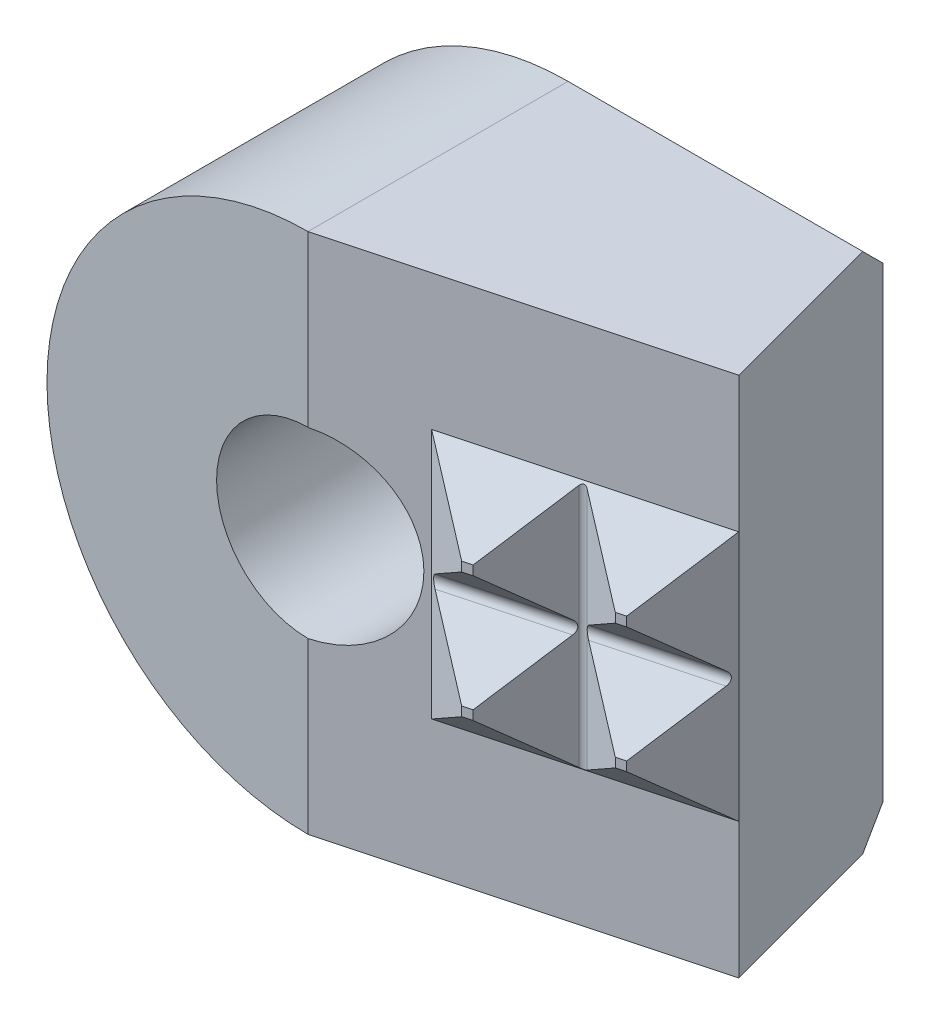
ISO-10303-21;
HEADER;
FILE_DESCRIPTION(('STEP AP214'),'2;1');
FILE_NAME('part.step','',(''),(''),'','','');
FILE_SCHEMA(('AUTOMOTIVE_DESIGN { 1 0 10303 214 1 1 1 1 }'));
ENDSEC;
DATA;
#1=APPLICATION_CONTEXT('core data for automotive mechanical design processes');
#2=APPLICATION_PROTOCOL_DEFINITION('international standard','automotive_design',2000,#1);
#3=PRODUCT_CONTEXT('',#1,'mechanical');
#4=PRODUCT('Part','Part','',(#3));
#5=PRODUCT_RELATED_PRODUCT_CATEGORY('part','',(#4));
#6=PRODUCT_DEFINITION_FORMATION('','',#4);
#7=PRODUCT_DEFINITION_CONTEXT('part definition',#1,'design');
#8=PRODUCT_DEFINITION('design','',#6,#7);
#9=PRODUCT_DEFINITION_SHAPE('','',#8);
#10=(LENGTH_UNIT() NAMED_UNIT(*) SI_UNIT(.MILLI.,.METRE.));
#11=(NAMED_UNIT(*) PLANE_ANGLE_UNIT() SI_UNIT($,.RADIAN.));
#12=(NAMED_UNIT(*) SI_UNIT($,.STERADIAN.) SOLID_ANGLE_UNIT());
#13=UNCERTAINTY_MEASURE_WITH_UNIT(LENGTH_MEASURE(1.E-05),#10,'distance_accuracy_value','');
#14=(GEOMETRIC_REPRESENTATION_CONTEXT(3) GLOBAL_UNCERTAINTY_ASSIGNED_CONTEXT((#13)) GLOBAL_UNIT_ASSIGNED_CONTEXT((#10,
#11,#12)) REPRESENTATION_CONTEXT('',''));
#15=CARTESIAN_POINT('',(0.,0.,0.));
#16=DIRECTION('',(0.,0.,1.));
#17=DIRECTION('',(1.,0.,0.));
#18=AXIS2_PLACEMENT_3D('',#15,#16,#17);
#19=CARTESIAN_POINT('',(2.66743829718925,-7.1374,7.16091854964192));
#20=DIRECTION('',(-0.258819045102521,0.,-0.965925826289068));
#21=DIRECTION('',(0.965925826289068,0.,-0.258819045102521));
#22=AXIS2_PLACEMENT_3D('',#19,#20,#21);
#23=PLANE('',#22);
#24=DIRECTION('',(0.,1.,0.));
#25=VECTOR('',#24,1.);
#26=CARTESIAN_POINT('',(0.00618209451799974,-7.1374,7.874));
#27=LINE('',#26,#25);
#28=CARTESIAN_POINT('',(0.00618209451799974,2.49999235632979,7.874));
#29=VERTEX_POINT('',#28);
#30=CARTESIAN_POINT('',(0.00618209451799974,7.1374,7.874));
#31=VERTEX_POINT('',#30);
#32=EDGE_CURVE('E184',#29,#31,#27,.T.);
#33=ORIENTED_EDGE('',*,*,#32,.F.);
#34=CARTESIAN_POINT('',(0.,0.,7.87565648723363));
#35=DIRECTION('',(-0.258819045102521,0.,-0.965925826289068));
#36=DIRECTION('',(0.965925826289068,0.,-0.258819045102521));
#37=AXIS2_PLACEMENT_3D('',#34,#35,#36);
#38=ELLIPSE('',#37,2.58819045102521,2.5);
#39=CARTESIAN_POINT('',(0.00618209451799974,-2.49999235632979,7.874));
#40=VERTEX_POINT('',#39);
#41=EDGE_CURVE('E28',#29,#40,#38,.T.);
#42=ORIENTED_EDGE('',*,*,#41,.T.);
#43=CARTESIAN_POINT('',(0.00618209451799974,-7.1374,7.874));
#44=VERTEX_POINT('',#43);
#45=EDGE_CURVE('E181',#44,#40,#27,.T.);
#46=ORIENTED_EDGE('',*,*,#45,.F.);
#47=DIRECTION('',(-0.965925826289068,0.,0.258819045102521));
#48=VECTOR('',#47,1.);
#49=CARTESIAN_POINT('',(2.66743829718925,-7.1374,7.16091854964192));
#50=LINE('',#49,#48);
#51=CARTESIAN_POINT('',(9.29175761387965,-7.1374,5.38593753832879));
#52=VERTEX_POINT('',#51);
#53=EDGE_CURVE('E272',#52,#44,#50,.T.);
#54=ORIENTED_EDGE('',*,*,#53,.F.);
#55=DIRECTION('',(0.,1.,0.));
#56=VECTOR('',#55,1.);
#57=CARTESIAN_POINT('',(9.29175761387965,-7.1374,5.3859375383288));
#58=LINE('',#57,#56);
#59=CARTESIAN_POINT('',(9.2917576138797,-3.4289999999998,5.38593753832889));
#60=VERTEX_POINT('',#59);
#61=EDGE_CURVE('E264',#52,#60,#58,.T.);
#62=ORIENTED_EDGE('',*,*,#61,.T.);
#63=DIRECTION('',(0.965925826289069,0.,-0.25881904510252));
#64=VECTOR('',#63,1.);
#65=CARTESIAN_POINT('',(-6.76123337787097,-3.4289999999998,9.68732351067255));
#66=LINE('',#65,#64);
#67=CARTESIAN_POINT('',(2.66743829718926,-3.4289999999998,7.16091854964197));
#68=VERTEX_POINT('',#67);
#69=EDGE_CURVE('E356',#68,#60,#66,.T.);
#70=ORIENTED_EDGE('',*,*,#69,.F.);
#71=DIRECTION('',(0.,1.,0.));
#72=VECTOR('',#71,1.);
#73=CARTESIAN_POINT('',(2.66743829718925,-7.1374,7.16091854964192));
#74=LINE('',#73,#72);
#75=CARTESIAN_POINT('',(2.66743829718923,3.42900000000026,7.16091854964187));
#76=VERTEX_POINT('',#75);
#77=EDGE_CURVE('E189',#68,#76,#74,.T.);
#78=ORIENTED_EDGE('',*,*,#77,.T.);
#79=DIRECTION('',(0.965925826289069,0.,-0.25881904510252));
#80=VECTOR('',#79,1.);
#81=CARTESIAN_POINT('',(-6.761233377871,3.42900000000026,9.68732351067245));
#82=LINE('',#81,#80);
#83=CARTESIAN_POINT('',(9.29175761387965,3.42900000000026,5.3859375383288));
#84=VERTEX_POINT('',#83);
#85=EDGE_CURVE('E355',#76,#84,#82,.T.);
#86=ORIENTED_EDGE('',*,*,#85,.T.);
#87=DIRECTION('',(0.,-1.,0.));
#88=VECTOR('',#87,1.);
#89=CARTESIAN_POINT('',(9.2917576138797,7.57101253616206,5.38593753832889));
#90=LINE('',#89,#88);
#91=CARTESIAN_POINT('',(9.29175761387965,7.1374,5.3859375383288));
#92=VERTEX_POINT('',#91);
#93=EDGE_CURVE('E185',#92,#84,#90,.T.);
#94=ORIENTED_EDGE('',*,*,#93,.F.);
#95=DIRECTION('',(-0.965925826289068,0.,0.258819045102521));
#96=VECTOR('',#95,1.);
#97=CARTESIAN_POINT('',(2.66743829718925,7.1374,7.16091854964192));
#98=LINE('',#97,#96);
#99=EDGE_CURVE('E278',#92,#31,#98,.T.);
#100=ORIENTED_EDGE('',*,*,#99,.T.);
#101=EDGE_LOOP('',(#33,#42,#46,#54,#62,#70,#78,#86,#94,#100));
#102=FACE_BOUND('',#101,.T.);
#103=ADVANCED_FACE('F14',(#102),#23,.F.);
#104=CARTESIAN_POINT('',(0.00618209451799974,-7.1374,7.874));
#105=DIRECTION('',(0.,0.,-1.));
#106=DIRECTION('',(0.,1.,0.));
#107=AXIS2_PLACEMENT_3D('',#104,#105,#106);
#108=PLANE('',#107);
#109=ORIENTED_EDGE('',*,*,#45,.T.);
#110=CARTESIAN_POINT('',(0.,0.,7.874));
#111=DIRECTION('',(0.,0.,-1.));
#112=DIRECTION('',(0.,1.,0.));
#113=AXIS2_PLACEMENT_3D('',#110,#111,#112);
#114=CIRCLE('',#113,2.5);
#115=EDGE_CURVE('E172',#40,#29,#114,.T.);
#116=ORIENTED_EDGE('',*,*,#115,.T.);
#117=ORIENTED_EDGE('',*,*,#32,.T.);
#118=DIRECTION('',(-1.,0.,0.));
#119=VECTOR('',#118,1.);
#120=CARTESIAN_POINT('',(0.00618209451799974,7.1374,7.874));
#121=LINE('',#120,#119);
#122=CARTESIAN_POINT('',(0.,7.1374,7.874));
#123=VERTEX_POINT('',#122);
#124=EDGE_CURVE('E280',#31,#123,#121,.T.);
#125=ORIENTED_EDGE('',*,*,#124,.T.);
#126=CARTESIAN_POINT('',(0.,0.,7.874));
#127=DIRECTION('',(0.,0.,-1.));
#128=DIRECTION('',(0.,1.,0.));
#129=AXIS2_PLACEMENT_3D('',#126,#127,#128);
#130=CIRCLE('',#129,7.1374);
#131=CARTESIAN_POINT('',(0.,-7.1374,7.874));
#132=VERTEX_POINT('',#131);
#133=EDGE_CURVE('E196',#132,#123,#130,.T.);
#134=ORIENTED_EDGE('',*,*,#133,.F.);
#135=DIRECTION('',(-1.,0.,0.));
#136=VECTOR('',#135,1.);
#137=CARTESIAN_POINT('',(0.00618209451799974,-7.1374,7.874));
#138=LINE('',#137,#136);
#139=EDGE_CURVE('E188',#44,#132,#138,.T.);
#140=ORIENTED_EDGE('',*,*,#139,.F.);
#141=EDGE_LOOP('',(#109,#116,#117,#125,#134,#140));
#142=FACE_BOUND('',#141,.T.);
#143=ADVANCED_FACE('F16',(#142),#108,.F.);
#144=CARTESIAN_POINT('',(9.29175761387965,-7.1374,5.3859375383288));
#145=DIRECTION('',(-0.86602540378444,0.,-0.5));
#146=DIRECTION('',(0.5,0.,-0.86602540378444));
#147=AXIS2_PLACEMENT_3D('',#144,#145,#146);
#148=PLANE('',#147);
#149=EDGE_CURVE('E267',#60,#84,#58,.T.);
#150=ORIENTED_EDGE('',*,*,#149,.T.);
#151=DIRECTION('',(-0.408248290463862,-0.577350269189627,0.707106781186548));
#152=VECTOR('',#151,1.);
#153=CARTESIAN_POINT('',(6.80123324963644,-0.0931333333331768,9.69965227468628));
#154=LINE('',#153,#152);
#155=CARTESIAN_POINT('',(8.169225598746,1.84150000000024,7.33022002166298));
#156=VERTEX_POINT('',#155);
#157=EDGE_CURVE('E321',#84,#156,#154,.T.);
#158=ORIENTED_EDGE('',*,*,#157,.T.);
#159=DIRECTION('',(0.,1.,0.));
#160=VECTOR('',#159,1.);
#161=CARTESIAN_POINT('',(8.169225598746,-7.1374,7.33022002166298));
#162=LINE('',#161,#160);
#163=CARTESIAN_POINT('',(8.169225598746,1.58750000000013,7.33022002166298));
#164=VERTEX_POINT('',#163);
#165=EDGE_CURVE('E260',#164,#156,#162,.T.);
#166=ORIENTED_EDGE('',*,*,#165,.F.);
#167=DIRECTION('',(0.408248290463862,-0.577350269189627,-0.707106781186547));
#168=VECTOR('',#167,1.);
#169=CARTESIAN_POINT('',(10.9740589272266,-2.37913333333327,2.47210618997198));
#170=LINE('',#169,#168);
#171=CARTESIAN_POINT('',(9.1647576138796,0.179605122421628,5.60590799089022));
#172=VERTEX_POINT('',#171);
#173=EDGE_CURVE('E294',#164,#172,#170,.T.);
#174=ORIENTED_EDGE('',*,*,#173,.T.);
#175=CARTESIAN_POINT('',(9.0377576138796,2.45824320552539E-13,5.82587844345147));
#176=DIRECTION('',(-0.86602540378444,0.,-0.5));
#177=DIRECTION('',(0.5,0.,-0.86602540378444));
#178=AXIS2_PLACEMENT_3D('',#175,#176,#177);
#179=ELLIPSE('',#178,0.359210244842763,0.254);
#180=CARTESIAN_POINT('',(9.16475761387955,-0.179605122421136,5.60590799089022));
#181=VERTEX_POINT('',#180);
#182=EDGE_CURVE('E239',#181,#172,#179,.F.);
#183=ORIENTED_EDGE('',*,*,#182,.F.);
#184=DIRECTION('',(0.408248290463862,0.577350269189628,-0.707106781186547));
#185=VECTOR('',#184,1.);
#186=CARTESIAN_POINT('',(7.60945630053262,-2.37913333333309,8.29976888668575));
#187=LINE('',#186,#185);
#188=CARTESIAN_POINT('',(8.169225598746,-1.58749999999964,7.33022002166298));
#189=VERTEX_POINT('',#188);
#190=EDGE_CURVE('E309',#189,#181,#187,.T.);
#191=ORIENTED_EDGE('',*,*,#190,.F.);
#192=CARTESIAN_POINT('',(8.169225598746,-1.84149999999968,7.33022002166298));
#193=VERTEX_POINT('',#192);
#194=EDGE_CURVE('E263',#193,#189,#162,.T.);
#195=ORIENTED_EDGE('',*,*,#194,.F.);
#196=DIRECTION('',(-0.408248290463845,0.577350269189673,0.707106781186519));
#197=VECTOR('',#196,1.);
#198=CARTESIAN_POINT('',(10.1658358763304,-4.66513333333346,3.87198957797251));
#199=LINE('',#198,#197);
#200=EDGE_CURVE('E342',#60,#193,#199,.T.);
#201=ORIENTED_EDGE('',*,*,#200,.F.);
#202=EDGE_LOOP('',(#150,#158,#166,#174,#183,#191,#195,#201));
#203=FACE_BOUND('',#202,.T.);
#204=ADVANCED_FACE('F401',(#203),#148,.F.);
#205=CARTESIAN_POINT('',(8.169225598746,-7.1374,7.33022002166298));
#206=DIRECTION('',(-0.25881904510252,0.,-0.965925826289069));
#207=DIRECTION('',(0.965925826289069,0.,-0.25881904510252));
#208=AXIS2_PLACEMENT_3D('',#205,#206,#207);
#209=PLANE('',#208);
#210=DIRECTION('',(0.965925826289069,0.,-0.25881904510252));
#211=VECTOR('',#210,1.);
#212=CARTESIAN_POINT('',(8.169225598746,-1.58749999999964,7.33022002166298));
#213=LINE('',#212,#211);
#214=CARTESIAN_POINT('',(7.9238804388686,-1.58749999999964,7.39596005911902));
#215=VERTEX_POINT('',#214);
#216=EDGE_CURVE('E311',#215,#189,#213,.T.);
#217=ORIENTED_EDGE('',*,*,#216,.F.);
#218=DIRECTION('',(0.,1.,0.));
#219=VECTOR('',#218,1.);
#220=CARTESIAN_POINT('',(7.9238804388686,-7.1374,7.39596005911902));
#221=LINE('',#220,#219);
#222=CARTESIAN_POINT('',(7.9238804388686,-1.84149999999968,7.39596005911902));
#223=VERTEX_POINT('',#222);
#224=EDGE_CURVE('E259',#223,#215,#221,.T.);
#225=ORIENTED_EDGE('',*,*,#224,.F.);
#226=DIRECTION('',(-0.965925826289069,0.,0.25881904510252));
#227=VECTOR('',#226,1.);
#228=CARTESIAN_POINT('',(8.169225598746,-1.84149999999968,7.33022002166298));
#229=LINE('',#228,#227);
#230=EDGE_CURVE('E344',#193,#223,#229,.T.);
#231=ORIENTED_EDGE('',*,*,#230,.F.);
#232=ORIENTED_EDGE('',*,*,#194,.T.);
#233=EDGE_LOOP('',(#217,#225,#231,#232));
#234=FACE_BOUND('',#233,.T.);
#235=ADVANCED_FACE('F408',(#234),#209,.F.);
#236=ORIENTED_EDGE('',*,*,#165,.T.);
#237=DIRECTION('',(-0.965925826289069,0.,0.25881904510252));
#238=VECTOR('',#237,1.);
#239=CARTESIAN_POINT('',(8.169225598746,1.84150000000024,7.33022002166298));
#240=LINE('',#239,#238);
#241=CARTESIAN_POINT('',(7.9238804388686,1.84150000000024,7.39596005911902));
#242=VERTEX_POINT('',#241);
#243=EDGE_CURVE('E324',#156,#242,#240,.T.);
#244=ORIENTED_EDGE('',*,*,#243,.T.);
#245=CARTESIAN_POINT('',(7.9238804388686,1.58750000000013,7.39596005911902));
#246=VERTEX_POINT('',#245);
#247=EDGE_CURVE('E256',#246,#242,#221,.T.);
#248=ORIENTED_EDGE('',*,*,#247,.F.);
#249=DIRECTION('',(0.965925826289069,0.,-0.25881904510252));
#250=VECTOR('',#249,1.);
#251=CARTESIAN_POINT('',(8.169225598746,1.58750000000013,7.33022002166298));
#252=LINE('',#251,#250);
#253=EDGE_CURVE('E297',#246,#164,#252,.T.);
#254=ORIENTED_EDGE('',*,*,#253,.T.);
#255=EDGE_LOOP('',(#236,#244,#248,#254));
#256=FACE_BOUND('',#255,.T.);
#257=ADVANCED_FACE('F476',(#256),#209,.F.);
#258=CARTESIAN_POINT('',(7.9238804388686,-7.1374,7.39596005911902));
#259=DIRECTION('',(0.5,0.,-0.86602540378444));
#260=DIRECTION('',(0.86602540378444,0.,0.5));
#261=AXIS2_PLACEMENT_3D('',#258,#259,#260);
#262=PLANE('',#261);
#263=ORIENTED_EDGE('',*,*,#247,.T.);
#264=DIRECTION('',(-0.707106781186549,0.577350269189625,-0.408248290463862));
#265=VECTOR('',#264,1.);
#266=CARTESIAN_POINT('',(11.5895010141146,-1.1514666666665,9.51230708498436));
#267=LINE('',#266,#265);
#268=CARTESIAN_POINT('',(6.08958318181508,3.33919743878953,6.33692804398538));
#269=VERTEX_POINT('',#268);
#270=EDGE_CURVE('E327',#242,#269,#267,.T.);
#271=ORIENTED_EDGE('',*,*,#270,.T.);
#272=DIRECTION('',(0.,1.,0.));
#273=VECTOR('',#272,1.);
#274=CARTESIAN_POINT('',(6.08958318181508,-7.1374,6.33692804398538));
#275=LINE('',#274,#273);
#276=CARTESIAN_POINT('',(6.08958318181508,-3.33919743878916,6.33692804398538));
#277=VERTEX_POINT('',#276);
#278=EDGE_CURVE('E253',#277,#269,#275,.T.);
#279=ORIENTED_EDGE('',*,*,#278,.F.);
#280=DIRECTION('',(-0.707106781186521,-0.577350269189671,-0.408248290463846));
#281=VECTOR('',#280,1.);
#282=CARTESIAN_POINT('',(5.7618383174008,-3.60680000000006,6.14770445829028));
#283=LINE('',#282,#281);
#284=EDGE_CURVE('E346',#223,#277,#283,.T.);
#285=ORIENTED_EDGE('',*,*,#284,.F.);
#286=ORIENTED_EDGE('',*,*,#224,.T.);
#287=DIRECTION('',(0.707106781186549,-0.577350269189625,0.408248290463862));
#288=VECTOR('',#287,1.);
#289=CARTESIAN_POINT('',(10.1896176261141,-3.43746666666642,8.70408403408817));
#290=LINE('',#289,#288);
#291=CARTESIAN_POINT('',(6.19956840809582,-0.179605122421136,6.40042804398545));
#292=VERTEX_POINT('',#291);
#293=EDGE_CURVE('E313',#292,#215,#290,.T.);
#294=ORIENTED_EDGE('',*,*,#293,.F.);
#295=CARTESIAN_POINT('',(6.41953886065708,2.45877577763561E-13,6.52742804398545));
#296=DIRECTION('',(0.5,0.,-0.86602540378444));
#297=DIRECTION('',(0.86602540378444,0.,0.5));
#298=AXIS2_PLACEMENT_3D('',#295,#296,#297);
#299=ELLIPSE('',#298,0.359210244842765,0.254);
#300=CARTESIAN_POINT('',(6.19956840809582,0.179605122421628,6.40042804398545));
#301=VERTEX_POINT('',#300);
#302=EDGE_CURVE('E317',#301,#292,#299,.F.);
#303=ORIENTED_EDGE('',*,*,#302,.F.);
#304=DIRECTION('',(0.707106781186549,0.577350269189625,0.408248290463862));
#305=VECTOR('',#304,1.);
#306=CARTESIAN_POINT('',(4.36195492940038,-1.3207999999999,5.33948140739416));
#307=LINE('',#306,#305);
#308=EDGE_CURVE('E300',#301,#246,#307,.T.);
#309=ORIENTED_EDGE('',*,*,#308,.T.);
#310=EDGE_LOOP('',(#263,#271,#279,#285,#286,#294,#303,#309));
#311=FACE_BOUND('',#310,.T.);
#312=ADVANCED_FACE('F420',(#311),#262,.F.);
#313=CARTESIAN_POINT('',(6.0260831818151,-7.1374,6.446913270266));
#314=DIRECTION('',(0.,1.,0.));
#315=DIRECTION('',(0.,0.,1.));
#316=AXIS2_PLACEMENT_3D('',#313,#314,#315);
#317=CYLINDRICAL_SURFACE('',#316,0.126999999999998);
#318=ORIENTED_EDGE('',*,*,#278,.T.);
#319=CARTESIAN_POINT('',(6.0260831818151,3.24939487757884,6.446913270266));
#320=DIRECTION('',(-0.183012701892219,-0.707106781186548,-0.68301270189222));
#321=DIRECTION('',(-0.183012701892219,0.707106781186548,-0.68301270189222));
#322=AXIS2_PLACEMENT_3D('',#319,#320,#321);
#323=ELLIPSE('',#322,0.179605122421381,0.126999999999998);
#324=CARTESIAN_POINT('',(5.91609795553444,3.33919743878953,6.38341327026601));
#325=VERTEX_POINT('',#324);
#326=EDGE_CURVE('E330',#269,#325,#323,.F.);
#327=ORIENTED_EDGE('',*,*,#326,.T.);
#328=DIRECTION('',(0.,1.,0.));
#329=VECTOR('',#328,1.);
#330=CARTESIAN_POINT('',(5.91609795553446,-7.1374,6.38341327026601));
#331=LINE('',#330,#329);
#332=CARTESIAN_POINT('',(5.91609795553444,-3.33919743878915,6.38341327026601));
#333=VERTEX_POINT('',#332);
#334=EDGE_CURVE('E250',#333,#325,#331,.T.);
#335=ORIENTED_EDGE('',*,*,#334,.F.);
#336=CARTESIAN_POINT('',(6.0260831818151,-3.24939487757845,6.446913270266));
#337=DIRECTION('',(0.18301270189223,-0.707106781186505,0.683012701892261));
#338=DIRECTION('',(0.183012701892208,0.70710678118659,0.683012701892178));
#339=AXIS2_PLACEMENT_3D('',#336,#337,#338);
#340=ELLIPSE('',#339,0.179605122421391,0.126999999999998);
#341=EDGE_CURVE('E348',#277,#333,#340,.F.);
#342=ORIENTED_EDGE('',*,*,#341,.F.);
#343=EDGE_LOOP('',(#318,#327,#335,#342));
#344=FACE_BOUND('',#343,.T.);
#345=ADVANCED_FACE('F430',(#344),#317,.F.);
#346=CARTESIAN_POINT('',(5.91609795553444,-7.1374,6.383413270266));
#347=DIRECTION('',(-0.86602540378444,0.,-0.5));
#348=DIRECTION('',(0.5,0.,-0.86602540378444));
#349=AXIS2_PLACEMENT_3D('',#346,#347,#348);
#350=PLANE('',#349);
#351=ORIENTED_EDGE('',*,*,#334,.T.);
#352=DIRECTION('',(-0.408248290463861,-0.577350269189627,0.707106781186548));
#353=VECTOR('',#352,1.);
#354=CARTESIAN_POINT('',(3.4467402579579,-0.153001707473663,10.6604662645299));
#355=LINE('',#354,#353);
#356=CARTESIAN_POINT('',(4.85706594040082,1.84150000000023,8.21771052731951));
#357=VERTEX_POINT('',#356);
#358=EDGE_CURVE('E333',#325,#357,#355,.T.);
#359=ORIENTED_EDGE('',*,*,#358,.T.);
#360=DIRECTION('',(0.,1.,0.));
#361=VECTOR('',#360,1.);
#362=CARTESIAN_POINT('',(4.85706594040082,-7.1374,8.21771052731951));
#363=LINE('',#362,#361);
#364=CARTESIAN_POINT('',(4.85706594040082,1.58750000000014,8.21771052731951));
#365=VERTEX_POINT('',#364);
#366=EDGE_CURVE('E246',#365,#357,#363,.T.);
#367=ORIENTED_EDGE('',*,*,#366,.F.);
#368=DIRECTION('',(0.408248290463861,-0.577350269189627,-0.707106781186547));
#369=VECTOR('',#368,1.);
#370=CARTESIAN_POINT('',(7.6195659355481,-2.31926495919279,3.43292017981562));
#371=LINE('',#370,#369);
#372=CARTESIAN_POINT('',(5.85259795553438,0.179605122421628,6.49339849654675));
#373=VERTEX_POINT('',#372);
#374=EDGE_CURVE('E303',#365,#373,#371,.T.);
#375=ORIENTED_EDGE('',*,*,#374,.T.);
#376=CARTESIAN_POINT('',(5.72559795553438,2.45891693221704E-13,6.713368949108));
#377=DIRECTION('',(-0.86602540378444,0.,-0.5));
#378=DIRECTION('',(0.5,0.,-0.86602540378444));
#379=AXIS2_PLACEMENT_3D('',#376,#377,#378);
#380=ELLIPSE('',#379,0.359210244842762,0.254);
#381=CARTESIAN_POINT('',(5.85259795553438,-0.179605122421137,6.49339849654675));
#382=VERTEX_POINT('',#381);
#383=EDGE_CURVE('E319',#382,#373,#380,.F.);
#384=ORIENTED_EDGE('',*,*,#383,.F.);
#385=DIRECTION('',(0.408248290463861,0.577350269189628,-0.707106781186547));
#386=VECTOR('',#385,1.);
#387=CARTESIAN_POINT('',(4.2549633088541,-2.43900170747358,9.26058287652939));
#388=LINE('',#387,#386);
#389=CARTESIAN_POINT('',(4.85706594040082,-1.58749999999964,8.21771052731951));
#390=VERTEX_POINT('',#389);
#391=EDGE_CURVE('E238',#390,#382,#388,.T.);
#392=ORIENTED_EDGE('',*,*,#391,.F.);
#393=CARTESIAN_POINT('',(4.85706594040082,-1.84149999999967,8.21771052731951));
#394=VERTEX_POINT('',#393);
#395=EDGE_CURVE('E237',#394,#390,#363,.T.);
#396=ORIENTED_EDGE('',*,*,#395,.F.);
#397=DIRECTION('',(-0.408248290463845,0.577350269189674,0.707106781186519));
#398=VECTOR('',#397,1.);
#399=CARTESIAN_POINT('',(6.81134288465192,-4.60526495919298,4.83280356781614));
#400=LINE('',#399,#398);
#401=EDGE_CURVE('E350',#333,#394,#400,.T.);
#402=ORIENTED_EDGE('',*,*,#401,.F.);
#403=EDGE_LOOP('',(#351,#359,#367,#375,#384,#392,#396,#402));
#404=FACE_BOUND('',#403,.T.);
#405=ADVANCED_FACE('F432',(#404),#350,.F.);
#406=CARTESIAN_POINT('',(4.85706594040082,-7.1374,8.21771052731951));
#407=DIRECTION('',(-0.258819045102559,0.,-0.965925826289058));
#408=DIRECTION('',(0.965925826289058,0.,-0.258819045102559));
#409=AXIS2_PLACEMENT_3D('',#406,#407,#408);
#410=PLANE('',#409);
#411=DIRECTION('',(0.965925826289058,0.,-0.258819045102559));
#412=VECTOR('',#411,1.);
#413=CARTESIAN_POINT('',(4.8570659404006,-1.58749999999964,8.21771052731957));
#414=LINE('',#413,#412);
#415=CARTESIAN_POINT('',(4.6117207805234,-1.58749999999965,8.28345056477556));
#416=VERTEX_POINT('',#415);
#417=EDGE_CURVE('E223',#416,#390,#414,.T.);
#418=ORIENTED_EDGE('',*,*,#417,.F.);
#419=DIRECTION('',(0.,1.,0.));
#420=VECTOR('',#419,1.);
#421=CARTESIAN_POINT('',(4.6117207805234,-7.1374,8.28345056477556));
#422=LINE('',#421,#420);
#423=CARTESIAN_POINT('',(4.6117207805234,-1.84149999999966,8.28345056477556));
#424=VERTEX_POINT('',#423);
#425=EDGE_CURVE('E235',#424,#416,#422,.T.);
#426=ORIENTED_EDGE('',*,*,#425,.F.);
#427=DIRECTION('',(-0.965925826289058,0.,0.258819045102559));
#428=VECTOR('',#427,1.);
#429=CARTESIAN_POINT('',(4.85706594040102,-1.84149999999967,8.21771052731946));
#430=LINE('',#429,#428);
#431=EDGE_CURVE('E352',#394,#424,#430,.T.);
#432=ORIENTED_EDGE('',*,*,#431,.F.);
#433=ORIENTED_EDGE('',*,*,#395,.T.);
#434=EDGE_LOOP('',(#418,#426,#432,#433));
#435=FACE_BOUND('',#434,.T.);
#436=ADVANCED_FACE('F233',(#435),#410,.F.);
#437=ORIENTED_EDGE('',*,*,#366,.T.);
#438=DIRECTION('',(-0.965925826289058,0.,0.258819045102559));
#439=VECTOR('',#438,1.);
#440=CARTESIAN_POINT('',(4.85706594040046,1.84150000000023,8.21771052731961));
#441=LINE('',#440,#439);
#442=CARTESIAN_POINT('',(4.6117207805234,1.84150000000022,8.28345056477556));
#443=VERTEX_POINT('',#442);
#444=EDGE_CURVE('E336',#357,#443,#441,.T.);
#445=ORIENTED_EDGE('',*,*,#444,.T.);
#446=CARTESIAN_POINT('',(4.6117207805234,1.58750000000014,8.28345056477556));
#447=VERTEX_POINT('',#446);
#448=EDGE_CURVE('E191',#447,#443,#422,.T.);
#449=ORIENTED_EDGE('',*,*,#448,.F.);
#450=DIRECTION('',(0.965925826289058,0.,-0.258819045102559));
#451=VECTOR('',#450,1.);
#452=CARTESIAN_POINT('',(4.85706594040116,1.58750000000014,8.21771052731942));
#453=LINE('',#452,#451);
#454=EDGE_CURVE('E306',#447,#365,#453,.T.);
#455=ORIENTED_EDGE('',*,*,#454,.T.);
#456=EDGE_LOOP('',(#437,#445,#449,#455));
#457=FACE_BOUND('',#456,.T.);
#458=ADVANCED_FACE('F439',(#457),#410,.F.);
#459=CARTESIAN_POINT('',(4.6117207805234,-7.1374,8.28345056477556));
#460=DIRECTION('',(0.5,0.,-0.86602540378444));
#461=DIRECTION('',(0.86602540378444,0.,0.5));
#462=AXIS2_PLACEMENT_3D('',#459,#460,#461);
#463=PLANE('',#462);
#464=ORIENTED_EDGE('',*,*,#448,.T.);
#465=DIRECTION('',(-0.70710678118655,0.577350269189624,-0.408248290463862));
#466=VECTOR('',#465,1.);
#467=CARTESIAN_POINT('',(8.27734135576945,-1.1514666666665,10.3997975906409));
#468=LINE('',#467,#466);
#469=EDGE_CURVE('E339',#443,#76,#468,.T.);
#470=ORIENTED_EDGE('',*,*,#469,.T.);
#471=ORIENTED_EDGE('',*,*,#77,.F.);
#472=DIRECTION('',(-0.707106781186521,-0.577350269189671,-0.408248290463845));
#473=VECTOR('',#472,1.);
#474=CARTESIAN_POINT('',(2.4496786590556,-3.60680000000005,7.03519496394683));
#475=LINE('',#474,#473);
#476=EDGE_CURVE('E245',#424,#68,#475,.T.);
#477=ORIENTED_EDGE('',*,*,#476,.F.);
#478=ORIENTED_EDGE('',*,*,#425,.T.);
#479=DIRECTION('',(0.70710678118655,-0.577350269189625,0.408248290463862));
#480=VECTOR('',#479,1.);
#481=CARTESIAN_POINT('',(6.87745796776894,-3.43746666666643,9.59157453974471));
#482=LINE('',#481,#480);
#483=CARTESIAN_POINT('',(2.88740874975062,-0.179605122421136,7.28791854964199));
#484=VERTEX_POINT('',#483);
#485=EDGE_CURVE('E22',#484,#416,#482,.T.);
#486=ORIENTED_EDGE('',*,*,#485,.F.);
#487=CARTESIAN_POINT('',(3.10737920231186,2.45944950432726E-13,7.41491854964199));
#488=DIRECTION('',(0.5,0.,-0.86602540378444));
#489=DIRECTION('',(0.86602540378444,0.,0.5));
#490=AXIS2_PLACEMENT_3D('',#487,#488,#489);
#491=ELLIPSE('',#490,0.359210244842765,0.254);
#492=CARTESIAN_POINT('',(2.88740874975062,0.179605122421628,7.28791854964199));
#493=VERTEX_POINT('',#492);
#494=EDGE_CURVE('E217',#493,#484,#491,.F.);
#495=ORIENTED_EDGE('',*,*,#494,.F.);
#496=DIRECTION('',(0.70710678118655,0.577350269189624,0.408248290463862));
#497=VECTOR('',#496,1.);
#498=CARTESIAN_POINT('',(1.04979527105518,-1.32079999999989,6.22697191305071));
#499=LINE('',#498,#497);
#500=EDGE_CURVE('E9',#493,#447,#499,.T.);
#501=ORIENTED_EDGE('',*,*,#500,.T.);
#502=EDGE_LOOP('',(#464,#470,#471,#477,#478,#486,#495,#501));
#503=FACE_BOUND('',#502,.T.);
#504=ADVANCED_FACE('F243',(#503),#463,.F.);
#505=CARTESIAN_POINT('',(6.0260831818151,-7.1374,6.446913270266));
#506=DIRECTION('',(0.,1.,0.));
#507=DIRECTION('',(0.,0.,1.));
#508=AXIS2_PLACEMENT_3D('',#505,#506,#507);
#509=PLANE('',#508);
#510=DIRECTION('',(0.25881904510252,0.,0.965925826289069));
#511=VECTOR('',#510,1.);
#512=CARTESIAN_POINT('',(7.8486,-7.1374,0.));
#513=LINE('',#512,#511);
#514=CARTESIAN_POINT('',(8.05277728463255,-7.1374,0.762000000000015));
#515=VERTEX_POINT('',#514);
#516=EDGE_CURVE('E193',#515,#52,#513,.T.);
#517=ORIENTED_EDGE('',*,*,#516,.T.);
#518=ORIENTED_EDGE('',*,*,#53,.T.);
#519=ORIENTED_EDGE('',*,*,#139,.T.);
#520=DIRECTION('',(0.,0.,-1.));
#521=VECTOR('',#520,1.);
#522=CARTESIAN_POINT('',(0.,-7.1374,7.874));
#523=LINE('',#522,#521);
#524=CARTESIAN_POINT('',(0.,-7.1374,0.762000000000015));
#525=VERTEX_POINT('',#524);
#526=EDGE_CURVE('E283',#132,#525,#523,.T.);
#527=ORIENTED_EDGE('',*,*,#526,.T.);
#528=DIRECTION('',(1.,0.,0.));
#529=VECTOR('',#528,1.);
#530=CARTESIAN_POINT('',(6.0260831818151,-7.1374,0.762000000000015));
#531=LINE('',#530,#529);
#532=EDGE_CURVE('E213',#525,#515,#531,.T.);
#533=ORIENTED_EDGE('',*,*,#532,.T.);
#534=EDGE_LOOP('',(#517,#518,#519,#527,#533));
#535=FACE_BOUND('',#534,.T.);
#536=ADVANCED_FACE('F467',(#535),#509,.F.);
#537=CARTESIAN_POINT('',(6.0260831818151,7.1374,6.446913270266));
#538=DIRECTION('',(0.,1.,0.));
#539=DIRECTION('',(0.,0.,1.));
#540=AXIS2_PLACEMENT_3D('',#537,#538,#539);
#541=PLANE('',#540);
#542=ORIENTED_EDGE('',*,*,#99,.F.);
#543=DIRECTION('',(0.25881904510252,0.,0.965925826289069));
#544=VECTOR('',#543,1.);
#545=CARTESIAN_POINT('',(7.8486,7.1374,0.));
#546=LINE('',#545,#544);
#547=CARTESIAN_POINT('',(8.0527772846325,7.1374,0.762000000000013));
#548=VERTEX_POINT('',#547);
#549=EDGE_CURVE('E275',#548,#92,#546,.T.);
#550=ORIENTED_EDGE('',*,*,#549,.F.);
#551=DIRECTION('',(-1.,0.,0.));
#552=VECTOR('',#551,1.);
#553=CARTESIAN_POINT('',(0.,7.1374,0.762000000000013));
#554=LINE('',#553,#552);
#555=CARTESIAN_POINT('',(0.,7.1374,0.762000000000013));
#556=VERTEX_POINT('',#555);
#557=EDGE_CURVE('E211',#548,#556,#554,.T.);
#558=ORIENTED_EDGE('',*,*,#557,.T.);
#559=DIRECTION('',(0.,0.,-1.));
#560=VECTOR('',#559,1.);
#561=CARTESIAN_POINT('',(0.,7.1374,7.874));
#562=LINE('',#561,#560);
#563=EDGE_CURVE('E282',#123,#556,#562,.T.);
#564=ORIENTED_EDGE('',*,*,#563,.F.);
#565=ORIENTED_EDGE('',*,*,#124,.F.);
#566=EDGE_LOOP('',(#542,#550,#558,#564,#565));
#567=FACE_BOUND('',#566,.T.);
#568=ADVANCED_FACE('F375',(#567),#541,.T.);
#569=CARTESIAN_POINT('',(-7.1374,-7.1374,0.));
#570=DIRECTION('',(0.,0.,1.));
#571=DIRECTION('',(-1.,0.,0.));
#572=AXIS2_PLACEMENT_3D('',#569,#570,#571);
#573=PLANE('',#572);
#574=CARTESIAN_POINT('',(0.,0.,0.));
#575=DIRECTION('',(0.,0.,-1.));
#576=DIRECTION('',(1.,0.,0.));
#577=AXIS2_PLACEMENT_3D('',#574,#575,#576);
#578=CIRCLE('',#577,2.5);
#579=CARTESIAN_POINT('',(2.5,0.,0.));
#580=VERTEX_POINT('',#579);
#581=EDGE_CURVE('E177',#580,#580,#578,.T.);
#582=ORIENTED_EDGE('',*,*,#581,.F.);
#583=EDGE_LOOP('',(#582));
#584=FACE_BOUND('',#583,.T.);
#585=CARTESIAN_POINT('',(0.,0.,0.));
#586=DIRECTION('',(0.,0.,1.));
#587=DIRECTION('',(-1.,0.,0.));
#588=AXIS2_PLACEMENT_3D('',#585,#586,#587);
#589=CIRCLE('',#588,6.3754);
#590=CARTESIAN_POINT('',(0.,-6.3754,0.));
#591=VERTEX_POINT('',#590);
#592=CARTESIAN_POINT('',(0.,6.3754,0.));
#593=VERTEX_POINT('',#592);
#594=EDGE_CURVE('E199',#591,#593,#589,.F.);
#595=ORIENTED_EDGE('',*,*,#594,.T.);
#596=DIRECTION('',(1.,0.,0.));
#597=VECTOR('',#596,1.);
#598=CARTESIAN_POINT('',(7.8486,6.3754,0.));
#599=LINE('',#598,#597);
#600=CARTESIAN_POINT('',(7.8486,6.3754,0.));
#601=VERTEX_POINT('',#600);
#602=EDGE_CURVE('E204',#593,#601,#599,.T.);
#603=ORIENTED_EDGE('',*,*,#602,.T.);
#604=DIRECTION('',(0.,1.,0.));
#605=VECTOR('',#604,1.);
#606=CARTESIAN_POINT('',(7.8486,-7.1374,0.));
#607=LINE('',#606,#605);
#608=CARTESIAN_POINT('',(7.8486,-6.3754,0.));
#609=VERTEX_POINT('',#608);
#610=EDGE_CURVE('E200',#609,#601,#607,.T.);
#611=ORIENTED_EDGE('',*,*,#610,.F.);
#612=DIRECTION('',(-1.,0.,0.));
#613=VECTOR('',#612,1.);
#614=CARTESIAN_POINT('',(-7.1374,-6.3754,0.));
#615=LINE('',#614,#613);
#616=EDGE_CURVE('E202',#609,#591,#615,.T.);
#617=ORIENTED_EDGE('',*,*,#616,.T.);
#618=EDGE_LOOP('',(#595,#603,#611,#617));
#619=FACE_BOUND('',#618,.T.);
#620=ADVANCED_FACE('F371',(#584,#619),#573,.F.);
#621=CARTESIAN_POINT('',(7.8486,-7.1374,0.));
#622=DIRECTION('',(-0.965925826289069,0.,0.25881904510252));
#623=DIRECTION('',(-0.25881904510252,0.,-0.965925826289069));
#624=AXIS2_PLACEMENT_3D('',#621,#622,#623);
#625=PLANE('',#624);
#626=ORIENTED_EDGE('',*,*,#610,.T.);
#627=DIRECTION('',(0.186156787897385,0.694746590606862,0.694746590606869));
#628=VECTOR('',#627,1.);
#629=CARTESIAN_POINT('',(7.32926991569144,4.43723373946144,-1.93816626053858));
#630=LINE('',#629,#628);
#631=EDGE_CURVE('E209',#601,#548,#630,.T.);
#632=ORIENTED_EDGE('',*,*,#631,.T.);
#633=ORIENTED_EDGE('',*,*,#549,.T.);
#634=ORIENTED_EDGE('',*,*,#93,.T.);
#635=ORIENTED_EDGE('',*,*,#149,.F.);
#636=ORIENTED_EDGE('',*,*,#61,.F.);
#637=ORIENTED_EDGE('',*,*,#516,.F.);
#638=DIRECTION('',(0.186156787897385,-0.694746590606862,0.694746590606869));
#639=VECTOR('',#638,1.);
#640=CARTESIAN_POINT('',(7.98254351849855,-6.87528401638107,0.499884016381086));
#641=LINE('',#640,#639);
#642=EDGE_CURVE('E207',#515,#609,#641,.F.);
#643=ORIENTED_EDGE('',*,*,#642,.T.);
#644=EDGE_LOOP('',(#626,#632,#633,#634,#635,#636,#637,#643));
#645=FACE_BOUND('',#644,.T.);
#646=ADVANCED_FACE('F374',(#645),#625,.F.);
#647=CARTESIAN_POINT('',(0.,0.,7.874));
#648=DIRECTION('',(0.,0.,-1.));
#649=DIRECTION('',(0.,1.,0.));
#650=AXIS2_PLACEMENT_3D('',#647,#648,#649);
#651=CYLINDRICAL_SURFACE('',#650,7.1374);
#652=ORIENTED_EDGE('',*,*,#563,.T.);
#653=CARTESIAN_POINT('',(0.,0.,0.762000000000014));
#654=DIRECTION('',(0.,0.,1.));
#655=DIRECTION('',(0.,-1.,0.));
#656=AXIS2_PLACEMENT_3D('',#653,#654,#655);
#657=CIRCLE('',#656,7.1374);
#658=EDGE_CURVE('E215',#556,#525,#657,.T.);
#659=ORIENTED_EDGE('',*,*,#658,.T.);
#660=ORIENTED_EDGE('',*,*,#526,.F.);
#661=ORIENTED_EDGE('',*,*,#133,.T.);
#662=EDGE_LOOP('',(#652,#659,#660,#661));
#663=FACE_BOUND('',#662,.T.);
#664=ADVANCED_FACE('F482',(#663),#651,.T.);
#665=CARTESIAN_POINT('',(6.0260831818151,-7.1374,0.762000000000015));
#666=DIRECTION('',(0.,0.707106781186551,0.707106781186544));
#667=DIRECTION('',(0.,-0.707106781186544,0.707106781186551));
#668=AXIS2_PLACEMENT_3D('',#665,#666,#667);
#669=PLANE('',#668);
#670=ORIENTED_EDGE('',*,*,#642,.F.);
#671=ORIENTED_EDGE('',*,*,#532,.F.);
#672=DIRECTION('',(0.,-0.707106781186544,0.707106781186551));
#673=VECTOR('',#672,1.);
#674=CARTESIAN_POINT('',(0.,-6.3754,0.));
#675=LINE('',#674,#673);
#676=EDGE_CURVE('E286',#591,#525,#675,.T.);
#677=ORIENTED_EDGE('',*,*,#676,.F.);
#678=ORIENTED_EDGE('',*,*,#616,.F.);
#679=EDGE_LOOP('',(#670,#671,#677,#678));
#680=FACE_BOUND('',#679,.T.);
#681=ADVANCED_FACE('F491',(#680),#669,.F.);
#682=CARTESIAN_POINT('',(0.,0.,0.762000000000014));
#683=DIRECTION('',(0.,0.,1.));
#684=DIRECTION('',(0.,-1.,0.));
#685=AXIS2_PLACEMENT_3D('',#682,#683,#684);
#686=CONICAL_SURFACE('',#685,7.1374,0.785398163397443);
#687=ORIENTED_EDGE('',*,*,#676,.T.);
#688=ORIENTED_EDGE('',*,*,#658,.F.);
#689=DIRECTION('',(0.,0.707106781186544,0.707106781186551));
#690=VECTOR('',#689,1.);
#691=CARTESIAN_POINT('',(0.,6.3754,0.));
#692=LINE('',#691,#690);
#693=EDGE_CURVE('E291',#593,#556,#692,.T.);
#694=ORIENTED_EDGE('',*,*,#693,.F.);
#695=ORIENTED_EDGE('',*,*,#594,.F.);
#696=EDGE_LOOP('',(#687,#688,#694,#695));
#697=FACE_BOUND('',#696,.T.);
#698=ADVANCED_FACE('F385',(#697),#686,.T.);
#699=CARTESIAN_POINT('',(-7.1374,6.3754,0.));
#700=DIRECTION('',(0.,0.707106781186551,-0.707106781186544));
#701=DIRECTION('',(0.,0.707106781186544,0.707106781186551));
#702=AXIS2_PLACEMENT_3D('',#699,#700,#701);
#703=PLANE('',#702);
#704=ORIENTED_EDGE('',*,*,#693,.T.);
#705=ORIENTED_EDGE('',*,*,#557,.F.);
#706=ORIENTED_EDGE('',*,*,#631,.F.);
#707=ORIENTED_EDGE('',*,*,#602,.F.);
#708=EDGE_LOOP('',(#704,#705,#706,#707));
#709=FACE_BOUND('',#708,.T.);
#710=ADVANCED_FACE('F388',(#709),#703,.T.);
#711=CARTESIAN_POINT('',(-6.31748812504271,1.71450000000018,11.3434033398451));
#712=DIRECTION('',(-0.183012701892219,-0.707106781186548,-0.68301270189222));
#713=DIRECTION('',(0.,0.694746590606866,-0.719254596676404));
#714=AXIS2_PLACEMENT_3D('',#711,#712,#713);
#715=PLANE('',#714);
#716=ORIENTED_EDGE('',*,*,#85,.F.);
#717=ORIENTED_EDGE('',*,*,#469,.F.);
#718=ORIENTED_EDGE('',*,*,#444,.F.);
#719=ORIENTED_EDGE('',*,*,#358,.F.);
#720=ORIENTED_EDGE('',*,*,#326,.F.);
#721=ORIENTED_EDGE('',*,*,#270,.F.);
#722=ORIENTED_EDGE('',*,*,#243,.F.);
#723=ORIENTED_EDGE('',*,*,#157,.F.);
#724=EDGE_LOOP('',(#716,#717,#718,#719,#720,#721,#722,#723));
#725=FACE_BOUND('',#724,.T.);
#726=ADVANCED_FACE('F437',(#725),#715,.F.);
#727=CARTESIAN_POINT('',(-6.31748812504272,-1.71449999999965,11.3434033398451));
#728=DIRECTION('',(0.18301270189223,-0.707106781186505,0.683012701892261));
#729=DIRECTION('',(0.,-0.694746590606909,-0.719254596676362));
#730=AXIS2_PLACEMENT_3D('',#727,#728,#729);
#731=PLANE('',#730);
#732=ORIENTED_EDGE('',*,*,#200,.T.);
#733=ORIENTED_EDGE('',*,*,#230,.T.);
#734=ORIENTED_EDGE('',*,*,#284,.T.);
#735=ORIENTED_EDGE('',*,*,#341,.T.);
#736=ORIENTED_EDGE('',*,*,#401,.T.);
#737=ORIENTED_EDGE('',*,*,#431,.T.);
#738=ORIENTED_EDGE('',*,*,#476,.T.);
#739=ORIENTED_EDGE('',*,*,#69,.T.);
#740=EDGE_LOOP('',(#732,#733,#734,#735,#736,#737,#738,#739));
#741=FACE_BOUND('',#740,.T.);
#742=ADVANCED_FACE('F426',(#741),#731,.T.);
#743=CARTESIAN_POINT('',(-6.66826292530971,2.46143796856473E-13,10.0342939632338));
#744=DIRECTION('',(0.965925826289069,0.,-0.25881904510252));
#745=DIRECTION('',(0.25881904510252,0.,0.965925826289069));
#746=AXIS2_PLACEMENT_3D('',#743,#744,#745);
#747=CYLINDRICAL_SURFACE('',#746,0.254);
#748=ORIENTED_EDGE('',*,*,#383,.T.);
#749=DIRECTION('',(0.965925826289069,0.,-0.25881904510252));
#750=VECTOR('',#749,1.);
#751=CARTESIAN_POINT('',(-6.71474815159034,0.179605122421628,9.86080873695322));
#752=LINE('',#751,#750);
#753=EDGE_CURVE('E362',#493,#373,#752,.T.);
#754=ORIENTED_EDGE('',*,*,#753,.F.);
#755=ORIENTED_EDGE('',*,*,#494,.T.);
#756=DIRECTION('',(0.965925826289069,0.,-0.25881904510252));
#757=VECTOR('',#756,1.);
#758=CARTESIAN_POINT('',(-6.71474815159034,-0.179605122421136,9.86080873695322));
#759=LINE('',#758,#757);
#760=EDGE_CURVE('E226',#484,#382,#759,.T.);
#761=ORIENTED_EDGE('',*,*,#760,.T.);
#762=EDGE_LOOP('',(#748,#754,#755,#761));
#763=FACE_BOUND('',#762,.T.);
#764=ADVANCED_FACE('F446',(#763),#747,.F.);
#765=CARTESIAN_POINT('',(-6.71474815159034,-0.179605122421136,9.86080873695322));
#766=DIRECTION('',(0.183012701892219,0.707106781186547,0.68301270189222));
#767=DIRECTION('',(0.,-0.694746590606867,0.719254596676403));
#768=AXIS2_PLACEMENT_3D('',#765,#766,#767);
#769=PLANE('',#768);
#770=ORIENTED_EDGE('',*,*,#391,.T.);
#771=ORIENTED_EDGE('',*,*,#760,.F.);
#772=ORIENTED_EDGE('',*,*,#485,.T.);
#773=ORIENTED_EDGE('',*,*,#417,.T.);
#774=EDGE_LOOP('',(#770,#771,#772,#773));
#775=FACE_BOUND('',#774,.T.);
#776=ADVANCED_FACE('F222',(#775),#769,.T.);
#777=CARTESIAN_POINT('',(-6.71474815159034,0.179605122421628,9.86080873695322));
#778=DIRECTION('',(-0.183012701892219,0.707106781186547,-0.68301270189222));
#779=DIRECTION('',(0.,0.694746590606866,0.719254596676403));
#780=AXIS2_PLACEMENT_3D('',#777,#778,#779);
#781=PLANE('',#780);
#782=ORIENTED_EDGE('',*,*,#454,.F.);
#783=ORIENTED_EDGE('',*,*,#500,.F.);
#784=ORIENTED_EDGE('',*,*,#753,.T.);
#785=ORIENTED_EDGE('',*,*,#374,.F.);
#786=EDGE_LOOP('',(#782,#783,#784,#785));
#787=FACE_BOUND('',#786,.T.);
#788=ADVANCED_FACE('F443',(#787),#781,.F.);
#789=ORIENTED_EDGE('',*,*,#253,.F.);
#790=ORIENTED_EDGE('',*,*,#308,.F.);
#791=EDGE_CURVE('E36',#301,#172,#752,.T.);
#792=ORIENTED_EDGE('',*,*,#791,.T.);
#793=ORIENTED_EDGE('',*,*,#173,.F.);
#794=EDGE_LOOP('',(#789,#790,#792,#793));
#795=FACE_BOUND('',#794,.T.);
#796=ADVANCED_FACE('F500',(#795),#781,.F.);
#797=ORIENTED_EDGE('',*,*,#190,.T.);
#798=EDGE_CURVE('E358',#292,#181,#759,.T.);
#799=ORIENTED_EDGE('',*,*,#798,.F.);
#800=ORIENTED_EDGE('',*,*,#293,.T.);
#801=ORIENTED_EDGE('',*,*,#216,.T.);
#802=EDGE_LOOP('',(#797,#799,#800,#801));
#803=FACE_BOUND('',#802,.T.);
#804=ADVANCED_FACE('F415',(#803),#769,.T.);
#805=ORIENTED_EDGE('',*,*,#182,.T.);
#806=ORIENTED_EDGE('',*,*,#791,.F.);
#807=ORIENTED_EDGE('',*,*,#302,.T.);
#808=ORIENTED_EDGE('',*,*,#798,.T.);
#809=EDGE_LOOP('',(#805,#806,#807,#808));
#810=FACE_BOUND('',#809,.T.);
#811=ADVANCED_FACE('F417',(#810),#747,.F.);
#812=CARTESIAN_POINT('',(0.,0.,8.28345056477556));
#813=DIRECTION('',(0.,0.,-1.));
#814=DIRECTION('',(1.,0.,0.));
#815=AXIS2_PLACEMENT_3D('',#812,#813,#814);
#816=CYLINDRICAL_SURFACE('',#815,2.5);
#817=ORIENTED_EDGE('',*,*,#581,.T.);
#818=EDGE_LOOP('',(#817));
#819=FACE_BOUND('',#818,.T.);
#820=ORIENTED_EDGE('',*,*,#115,.F.);
#821=ORIENTED_EDGE('',*,*,#41,.F.);
#822=EDGE_LOOP('',(#820,#821));
#823=FACE_BOUND('',#822,.T.);
#824=ADVANCED_FACE('F173',(#819,#823),#816,.F.);
#825=CLOSED_SHELL('',(#103,#143,#204,#235,#257,#312,#345,#405,#436,#458,#504,#536,#568,#620,
#646,#664,#681,#698,#710,#726,#742,#764,#776,#788,#796,#804,#811,#824));
#826=MANIFOLD_SOLID_BREP('B1',#825);
#827=ADVANCED_BREP_SHAPE_REPRESENTATION('',(#18,#826),#14);
#828=SHAPE_DEFINITION_REPRESENTATION(#9,#827);
ENDSEC;
END-ISO-10303-21;
